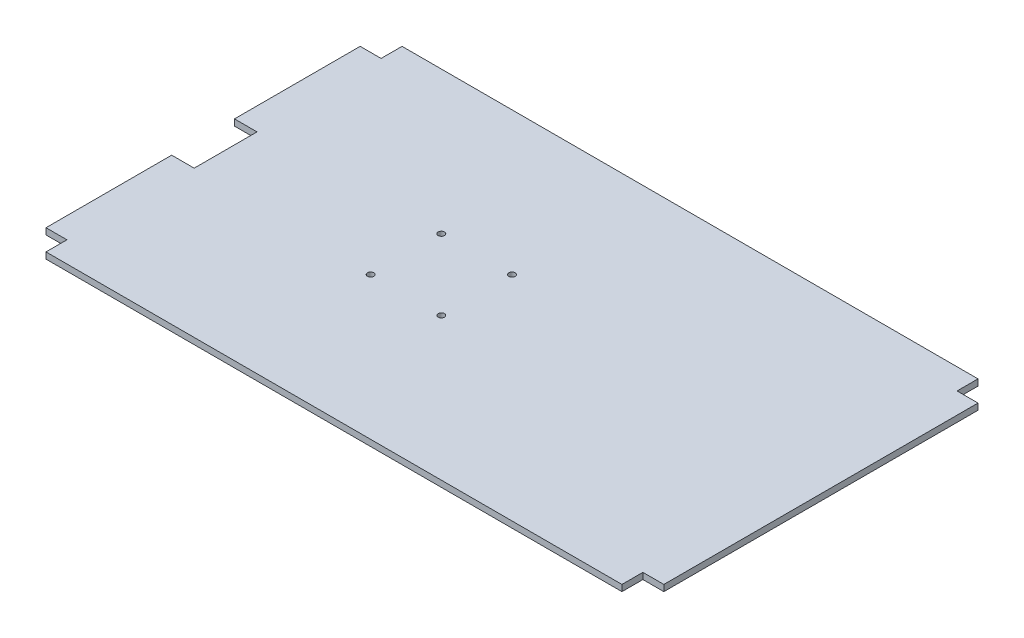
from build123d import *

# Parameters (mm, degrees)
BOSS_EXTRUDE1_DEPTH = 6
CUT_EXTRUDE1_REACH  = 683.061
SKETCH2_W           = 43
SKETCH2_H           = 120
CUT_EXTRUDE2_REACH  = 683.061
SKETCH4_R           = 6


with BuildPart() as part:
    # Sketch1 → Boss-Extrude1 (new, symmetric)
    with BuildSketch(Plane(origin=(0, 0, 0), x_dir=(1, 0, 0), z_dir=(0, 1, 0))):
        Polygon((-550, -340), (550, -340), (550, -300), (590, -300), (590, 300), (550, 300), (550, 340), (-550, 340), (-550, 300), (-590, 300), (-590, -300), (-550, -300), align=None)
    extrude(amount=BOSS_EXTRUDE1_DEPTH, both=True)

    # Sketch2 → Cut-Extrude1 (cut, up to next)
    with BuildSketch(Plane(origin=(0, 6, 0), x_dir=(1, 0, 0), z_dir=(0, 1, 0)), mode=Mode.PRIVATE) as cut_extrude1_sk1:
        with Locations((-568.5, 0)):
            Rectangle(SKETCH2_W, SKETCH2_H)
    cut_extrude1_tool1 = extrude(cut_extrude1_sk1.sketch, amount=-CUT_EXTRUDE1_REACH, mode=Mode.PRIVATE) & part.part
    add(cut_extrude1_tool1.solids().sort_by_distance((-568.5, 6, 0))[0], mode=Mode.SUBTRACT)

    # Sketch4 → Cut-Extrude2 (cut, up to next)
    with BuildSketch(Plane(origin=(0, 6, 0), x_dir=(1, 0, 0), z_dir=(0, 1, 0)), mode=Mode.PRIVATE) as cut_extrude2_sk1:
        with Locations(Location((-202.500015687, -67.5, 0), (0, 0, 270))):
            Circle(SKETCH4_R)
    cut_extrude2_tool1 = extrude(cut_extrude2_sk1.sketch, amount=-CUT_EXTRUDE2_REACH, mode=Mode.PRIVATE) & part.part
    # Sketch4 → Cut-Extrude2 (cut, up to next)
    with BuildSketch(Plane(origin=(0, 6, 0), x_dir=(1, 0, 0), z_dir=(0, 1, 0)), mode=Mode.PRIVATE) as cut_extrude2_sk2:
        with Locations(Location((-202.500015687, 67.5, 0), (0, 0, 270))):
            Circle(SKETCH4_R)
    cut_extrude2_tool2 = extrude(cut_extrude2_sk2.sketch, amount=-CUT_EXTRUDE2_REACH, mode=Mode.PRIVATE) & part.part
    # Sketch4 → Cut-Extrude2 (cut, up to next)
    with BuildSketch(Plane(origin=(0, 6, 0), x_dir=(1, 0, 0), z_dir=(0, 1, 0)), mode=Mode.PRIVATE) as cut_extrude2_sk3:
        with Locations(Location((-67.500015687, -67.5, 0), (0, 0, 270))):
            Circle(SKETCH4_R)
    cut_extrude2_tool3 = extrude(cut_extrude2_sk3.sketch, amount=-CUT_EXTRUDE2_REACH, mode=Mode.PRIVATE) & part.part
    # Sketch4 → Cut-Extrude2 (cut, up to next)
    with BuildSketch(Plane(origin=(0, 6, 0), x_dir=(1, 0, 0), z_dir=(0, 1, 0)), mode=Mode.PRIVATE) as cut_extrude2_sk4:
        with Locations(Location((-67.500015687, 67.5, 0), (0, 0, 270))):
            Circle(SKETCH4_R)
    cut_extrude2_tool4 = extrude(cut_extrude2_sk4.sketch, amount=-CUT_EXTRUDE2_REACH, mode=Mode.PRIVATE) & part.part
    add(cut_extrude2_tool1.solids().sort_by_distance((-202.500016, 6, 67.5))[0], mode=Mode.SUBTRACT)
    add(cut_extrude2_tool2.solids().sort_by_distance((-202.500016, 6, -67.5))[0], mode=Mode.SUBTRACT)
    add(cut_extrude2_tool3.solids().sort_by_distance((-67.500016, 6, 67.5))[0], mode=Mode.SUBTRACT)
    add(cut_extrude2_tool4.solids().sort_by_distance((-67.500016, 6, -67.5))[0], mode=Mode.SUBTRACT)


solid = part.part
